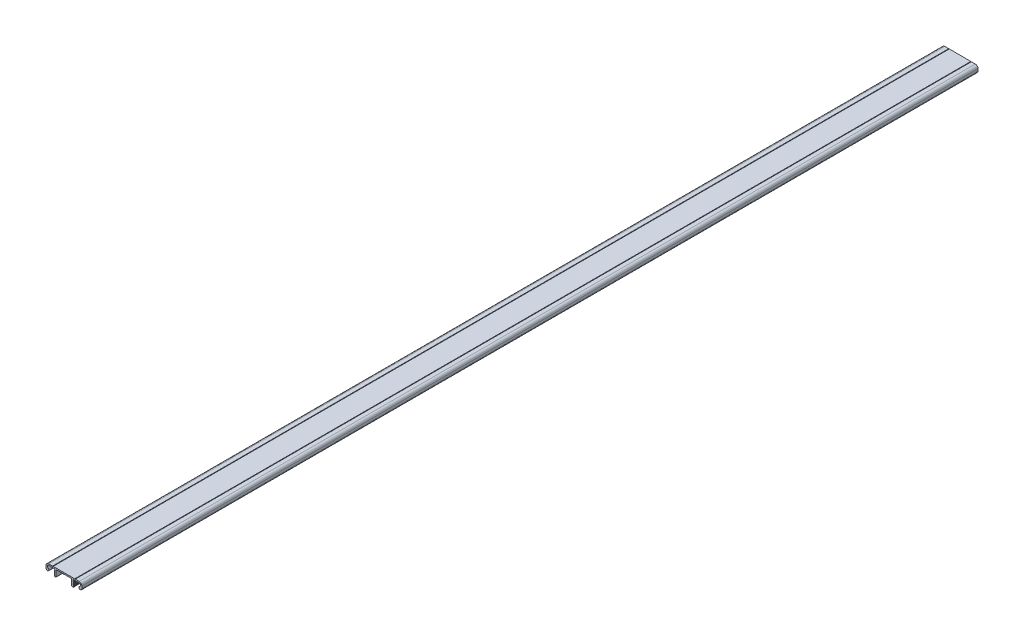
from build123d import *

# Parameters (mm, degrees)
AUFSATZ_LINEAR_AUSTRAGEN1_DEPTH = 1000


with BuildPart() as part:
    # Model → Aufsatz-Linear austragen1 (new body)
    with BuildSketch(Plane.XY):
        with BuildLine():
            Line((-31.2878942, 63.559171), (-55.3878688, 63.55917))
            Line((-55.3878688, 63.55917), (-55.6878658, 63.259171))
            Line((-55.6878658, 63.259171), (-55.9878648, 63.55917))
            Line((-55.9878648, 63.55917), (-60.3378808, 63.55919))
            ThreePointArc((-60.3378808, 63.55919), (-62.459214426, 62.680517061), (-63.3379008, 60.559189))
            Line((-63.3379008, 60.559189), (-63.3379018, 58.234874))
            ThreePointArc((-63.3379018, 58.234874), (-63.320791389, 57.973820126), (-63.2697528, 57.717233))
            Line((-63.2697528, 57.717233), (-63.1367768, 57.220966))
            ThreePointArc((-63.1367768, 57.220966), (-60.960261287, 56.297496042), (-60.5915008, 58.632883))
            Line((-60.5915008, 58.632883), (-61.4342728, 59.535505))
            ThreePointArc((-61.4342728, 59.535505), (-61.713643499, 61.156869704), (-60.3378818, 62.059173))
            Line((-60.3378818, 62.059173), (-54.0378808, 62.059174))
            ThreePointArc((-54.0378808, 62.059174), (-53.684326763, 61.912727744), (-53.5378798, 61.559174))
            Line((-53.5378798, 61.559174), (-53.5378788, 61.309166))
            Line((-53.5378788, 61.309166), (-54.0878788, 60.991623))
            Line((-54.0878788, 60.991623), (-54.0878808, 60.226708))
            Line((-54.0878808, 60.226708), (-53.5378798, 59.909165))
            Line((-53.5378798, 59.909165), (-54.0878788, 59.591627))
            Line((-54.0878788, 59.591627), (-54.0878778, 58.826721))
            Line((-54.0878778, 58.826721), (-53.5378798, 58.509178))
            Line((-53.5378798, 58.509178), (-54.0878798, 58.191637))
            Line((-54.0878798, 58.191637), (-54.0878798, 57.426734))
            Line((-54.0878798, 57.426734), (-53.5378798, 57.109194))
            Line((-53.5378798, 57.109194), (-54.0878808, 56.7916502))
            Line((-54.0878808, 56.7916502), (-54.0878808, 56.0267362))
            Line((-54.0878808, 56.0267362), (-53.5378788, 55.7091932))
            Line((-53.5378788, 55.7091932), (-54.0878808, 55.3916492))
            Line((-54.0878808, 55.3916492), (-54.0878798, 55.0591892))
            ThreePointArc((-54.0878798, 55.0591892), (-53.941433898, 54.705634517), (-53.5878798, 54.5591872))
            Line((-53.5878798, 54.5591872), (-52.5378778, 54.5591882))
            ThreePointArc((-52.5378778, 54.5591882), (-52.184323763, 54.705634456), (-52.0378768, 55.0591882))
            Line((-52.0378768, 55.0591882), (-52.0378748, 61.559178))
            ThreePointArc((-52.0378748, 61.559178), (-51.891428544, 61.912731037), (-51.5378758, 62.059178))
            Line((-51.5378758, 62.059178), (-43.6842938, 62.05918))
            ThreePointArc((-43.6842938, 62.05918), (-43.337882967, 61.759178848), (-42.991473, 62.059181))
            Line((-42.991473, 62.059181), (-35.137888, 62.059179))
            ThreePointArc((-35.137888, 62.059179), (-34.784334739, 61.91273232), (-34.6378882, 61.559179))
            Line((-34.6378882, 61.559179), (-34.6378862, 55.0591872))
            ThreePointArc((-34.6378862, 55.0591872), (-34.491439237, 54.705634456), (-34.1378862, 54.5591882))
            Line((-34.1378862, 54.5591882), (-33.0878972, 54.5591862))
            ThreePointArc((-33.0878972, 54.5591862), (-32.734342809, 54.705632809), (-32.5878962, 55.0591872))
            Line((-32.5878962, 55.0591872), (-32.5878972, 55.3916482))
            Line((-32.5878972, 55.3916482), (-33.1378972, 55.7091932))
            Line((-33.1378972, 55.7091932), (-32.5878982, 56.0267342))
            Line((-32.5878982, 56.0267342), (-32.5878982, 56.7916492))
            Line((-32.5878982, 56.7916492), (-33.1378982, 57.109192))
            Line((-33.1378982, 57.109192), (-32.5878982, 57.426735))
            Line((-32.5878982, 57.426735), (-32.5878992, 58.191639))
            Line((-32.5878992, 58.191639), (-33.1378992, 58.509182))
            Line((-33.1378992, 58.509182), (-32.5878972, 58.826725))
            Line((-32.5878972, 58.826725), (-32.5878972, 59.591632))
            Line((-32.5878972, 59.591632), (-33.1378982, 59.909171))
            Line((-33.1378982, 59.909171), (-32.5878972, 60.226711))
            Line((-32.5878972, 60.226711), (-32.5878972, 60.991622))
            Line((-32.5878972, 60.991622), (-33.1312802, 61.305343))
            Line((-33.1312802, 61.305343), (-33.1312792, 61.559175))
            ThreePointArc((-33.1312792, 61.559175), (-32.984832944, 61.912730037), (-32.6312782, 62.059177))
            Line((-32.6312782, 62.059177), (-26.3378912, 62.059173))
            ThreePointArc((-26.3378912, 62.059173), (-24.962130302, 61.156869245), (-25.2415012, 59.535505))
            Line((-25.2415012, 59.535505), (-26.084273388, 58.632883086))
            ThreePointArc((-26.084273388, 58.632883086), (-25.715514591, 56.297494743), (-23.53899843, 57.220966))
            Line((-23.53899843, 57.220966), (-23.4060362, 57.717187))
            ThreePointArc((-23.4060362, 57.717187), (-23.354997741, 57.973773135), (-23.3378872, 58.234826))
            Line((-23.3378872, 58.234826), (-23.3378872, 60.559193))
            ThreePointArc((-23.3378872, 60.559193), (-24.216569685, 62.680513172), (-26.3378922, 63.55919))
            Line((-26.3378922, 63.55919), (-30.6879012, 63.559174))
            Line((-30.6879012, 63.559174), (-30.9878972, 63.259174))
            Line((-30.9878972, 63.259174), (-31.2878942, 63.559171))
        make_face()
    extrude(amount=AUFSATZ_LINEAR_AUSTRAGEN1_DEPTH)


solid = part.part
